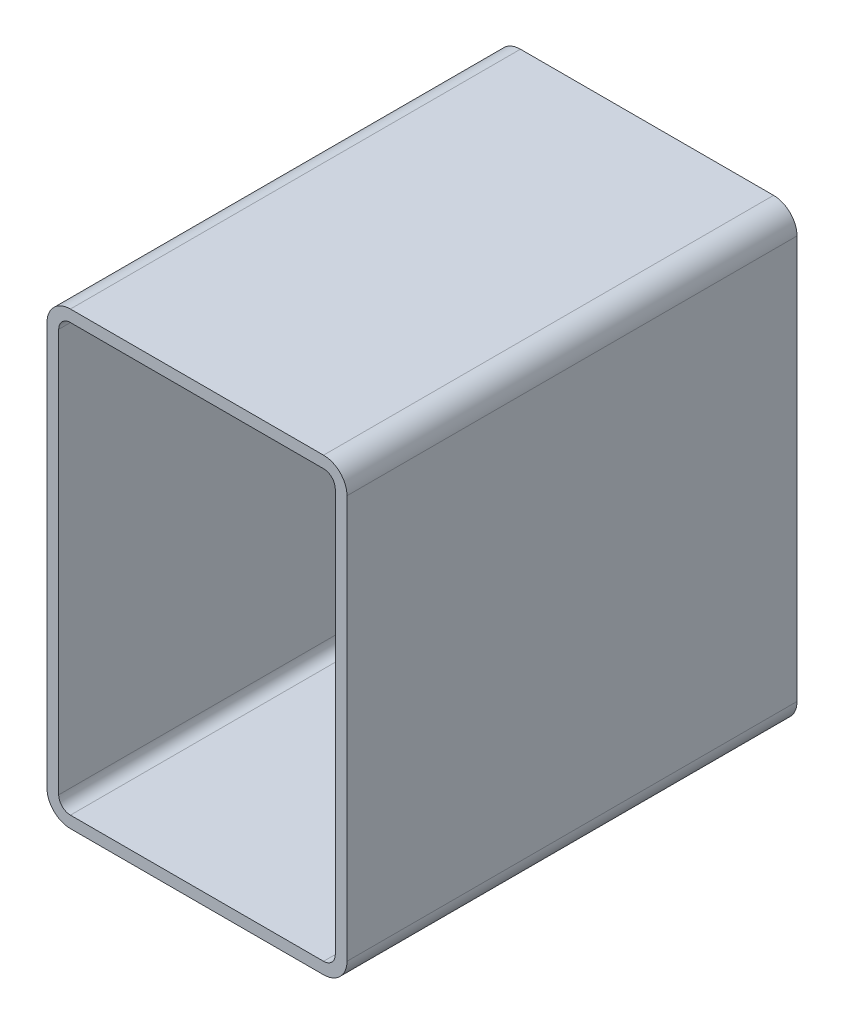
ISO-10303-21;
HEADER;
FILE_DESCRIPTION(('STEP AP214'),'2;1');
FILE_NAME('part.step','',(''),(''),'','','');
FILE_SCHEMA(('AUTOMOTIVE_DESIGN { 1 0 10303 214 1 1 1 1 }'));
ENDSEC;
DATA;
#1=APPLICATION_CONTEXT('core data for automotive mechanical design processes');
#2=APPLICATION_PROTOCOL_DEFINITION('international standard','automotive_design',2000,#1);
#3=PRODUCT_CONTEXT('',#1,'mechanical');
#4=PRODUCT('Part','Part','',(#3));
#5=PRODUCT_RELATED_PRODUCT_CATEGORY('part','',(#4));
#6=PRODUCT_DEFINITION_FORMATION('','',#4);
#7=PRODUCT_DEFINITION_CONTEXT('part definition',#1,'design');
#8=PRODUCT_DEFINITION('design','',#6,#7);
#9=PRODUCT_DEFINITION_SHAPE('','',#8);
#10=(LENGTH_UNIT() NAMED_UNIT(*) SI_UNIT(.MILLI.,.METRE.));
#11=(NAMED_UNIT(*) PLANE_ANGLE_UNIT() SI_UNIT($,.RADIAN.));
#12=(NAMED_UNIT(*) SI_UNIT($,.STERADIAN.) SOLID_ANGLE_UNIT());
#13=UNCERTAINTY_MEASURE_WITH_UNIT(LENGTH_MEASURE(1.E-05),#10,'distance_accuracy_value','');
#14=(GEOMETRIC_REPRESENTATION_CONTEXT(3) GLOBAL_UNCERTAINTY_ASSIGNED_CONTEXT((#13)) GLOBAL_UNIT_ASSIGNED_CONTEXT((#10,
#11,#12)) REPRESENTATION_CONTEXT('',''));
#15=CARTESIAN_POINT('',(0.,0.,0.));
#16=DIRECTION('',(0.,0.,1.));
#17=DIRECTION('',(1.,0.,0.));
#18=AXIS2_PLACEMENT_3D('',#15,#16,#17);
#19=CARTESIAN_POINT('',(17.2659404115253,290.799496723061,304.8));
#20=DIRECTION('',(0.,0.,1.));
#21=DIRECTION('',(1.,0.,0.));
#22=AXIS2_PLACEMENT_3D('',#19,#20,#21);
#23=PLANE('',#22);
#24=CARTESIAN_POINT('',(17.2659404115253,290.799496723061,304.8));
#25=DIRECTION('',(0.,0.,1.));
#26=DIRECTION('',(1.,0.,0.));
#27=AXIS2_PLACEMENT_3D('',#24,#25,#26);
#28=CIRCLE('',#27,15.875);
#29=CARTESIAN_POINT('',(17.2659404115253,306.674496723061,304.8));
#30=VERTEX_POINT('',#29);
#31=CARTESIAN_POINT('',(1.3909404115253,290.799496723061,304.8));
#32=VERTEX_POINT('',#31);
#33=EDGE_CURVE('E211',#30,#32,#28,.T.);
#34=ORIENTED_EDGE('',*,*,#33,.T.);
#35=DIRECTION('',(0.,-1.,0.));
#36=VECTOR('',#35,1.);
#37=CARTESIAN_POINT('',(1.3909404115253,17.7494967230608,304.8));
#38=LINE('',#37,#36);
#39=CARTESIAN_POINT('',(1.3909404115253,17.7494967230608,304.8));
#40=VERTEX_POINT('',#39);
#41=EDGE_CURVE('E214',#32,#40,#38,.T.);
#42=ORIENTED_EDGE('',*,*,#41,.T.);
#43=CARTESIAN_POINT('',(17.2659404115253,17.7494967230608,304.8));
#44=DIRECTION('',(0.,0.,1.));
#45=DIRECTION('',(1.,0.,0.));
#46=AXIS2_PLACEMENT_3D('',#43,#44,#45);
#47=CIRCLE('',#46,15.875);
#48=CARTESIAN_POINT('',(17.2659404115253,1.87449672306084,304.8));
#49=VERTEX_POINT('',#48);
#50=EDGE_CURVE('E217',#40,#49,#47,.T.);
#51=ORIENTED_EDGE('',*,*,#50,.T.);
#52=DIRECTION('',(1.,0.,0.));
#53=VECTOR('',#52,1.);
#54=CARTESIAN_POINT('',(188.715940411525,1.87449672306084,304.8));
#55=LINE('',#54,#53);
#56=CARTESIAN_POINT('',(188.715940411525,1.87449672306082,304.8));
#57=VERTEX_POINT('',#56);
#58=EDGE_CURVE('E219',#49,#57,#55,.T.);
#59=ORIENTED_EDGE('',*,*,#58,.T.);
#60=CARTESIAN_POINT('',(188.715940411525,17.7494967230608,304.8));
#61=DIRECTION('',(0.,0.,1.));
#62=DIRECTION('',(1.,0.,0.));
#63=AXIS2_PLACEMENT_3D('',#60,#61,#62);
#64=CIRCLE('',#63,15.875);
#65=CARTESIAN_POINT('',(204.590940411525,17.7494967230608,304.8));
#66=VERTEX_POINT('',#65);
#67=EDGE_CURVE('E221',#57,#66,#64,.T.);
#68=ORIENTED_EDGE('',*,*,#67,.T.);
#69=DIRECTION('',(0.,1.,0.));
#70=VECTOR('',#69,1.);
#71=CARTESIAN_POINT('',(204.590940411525,290.799496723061,304.8));
#72=LINE('',#71,#70);
#73=CARTESIAN_POINT('',(204.590940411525,290.799496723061,304.8));
#74=VERTEX_POINT('',#73);
#75=EDGE_CURVE('E223',#66,#74,#72,.T.);
#76=ORIENTED_EDGE('',*,*,#75,.T.);
#77=CARTESIAN_POINT('',(188.715940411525,290.799496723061,304.8));
#78=DIRECTION('',(0.,0.,1.));
#79=DIRECTION('',(1.,0.,0.));
#80=AXIS2_PLACEMENT_3D('',#77,#78,#79);
#81=CIRCLE('',#80,15.875);
#82=CARTESIAN_POINT('',(188.715940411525,306.674496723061,304.8));
#83=VERTEX_POINT('',#82);
#84=EDGE_CURVE('E225',#74,#83,#81,.T.);
#85=ORIENTED_EDGE('',*,*,#84,.T.);
#86=DIRECTION('',(-1.,0.,0.));
#87=VECTOR('',#86,1.);
#88=CARTESIAN_POINT('',(17.2659404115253,306.674496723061,304.8));
#89=LINE('',#88,#87);
#90=EDGE_CURVE('E227',#83,#30,#89,.T.);
#91=ORIENTED_EDGE('',*,*,#90,.T.);
#92=EDGE_LOOP('',(#34,#42,#51,#59,#68,#76,#85,#91));
#93=FACE_BOUND('',#92,.T.);
#94=DIRECTION('',(0.,-1.,0.));
#95=VECTOR('',#94,1.);
#96=CARTESIAN_POINT('',(9.3284404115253,17.7494967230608,304.8));
#97=LINE('',#96,#95);
#98=CARTESIAN_POINT('',(9.3284404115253,290.799496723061,304.8));
#99=VERTEX_POINT('',#98);
#100=CARTESIAN_POINT('',(9.3284404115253,17.7494967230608,304.8));
#101=VERTEX_POINT('',#100);
#102=EDGE_CURVE('E154',#99,#101,#97,.T.);
#103=ORIENTED_EDGE('',*,*,#102,.F.);
#104=CARTESIAN_POINT('',(17.2659404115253,290.799496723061,304.8));
#105=DIRECTION('',(0.,0.,1.));
#106=DIRECTION('',(1.,0.,0.));
#107=AXIS2_PLACEMENT_3D('',#104,#105,#106);
#108=CIRCLE('',#107,7.9375);
#109=CARTESIAN_POINT('',(17.2659404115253,298.736996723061,304.8));
#110=VERTEX_POINT('',#109);
#111=EDGE_CURVE('E146',#110,#99,#108,.T.);
#112=ORIENTED_EDGE('',*,*,#111,.F.);
#113=DIRECTION('',(-1.,0.,0.));
#114=VECTOR('',#113,1.);
#115=CARTESIAN_POINT('',(17.2659404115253,298.736996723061,304.8));
#116=LINE('',#115,#114);
#117=CARTESIAN_POINT('',(188.715940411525,298.736996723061,304.8));
#118=VERTEX_POINT('',#117);
#119=EDGE_CURVE('E179',#118,#110,#116,.T.);
#120=ORIENTED_EDGE('',*,*,#119,.F.);
#121=CARTESIAN_POINT('',(188.715940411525,290.799496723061,304.8));
#122=DIRECTION('',(0.,0.,1.));
#123=DIRECTION('',(1.,0.,0.));
#124=AXIS2_PLACEMENT_3D('',#121,#122,#123);
#125=CIRCLE('',#124,7.93750000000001);
#126=CARTESIAN_POINT('',(196.653440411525,290.799496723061,304.8));
#127=VERTEX_POINT('',#126);
#128=EDGE_CURVE('E177',#127,#118,#125,.T.);
#129=ORIENTED_EDGE('',*,*,#128,.F.);
#130=DIRECTION('',(0.,1.,0.));
#131=VECTOR('',#130,1.);
#132=CARTESIAN_POINT('',(196.653440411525,290.799496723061,304.8));
#133=LINE('',#132,#131);
#134=CARTESIAN_POINT('',(196.653440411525,17.7494967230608,304.8));
#135=VERTEX_POINT('',#134);
#136=EDGE_CURVE('E175',#135,#127,#133,.T.);
#137=ORIENTED_EDGE('',*,*,#136,.F.);
#138=CARTESIAN_POINT('',(188.715940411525,17.7494967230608,304.8));
#139=DIRECTION('',(0.,0.,1.));
#140=DIRECTION('',(1.,0.,0.));
#141=AXIS2_PLACEMENT_3D('',#138,#139,#140);
#142=CIRCLE('',#141,7.93750000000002);
#143=CARTESIAN_POINT('',(188.715940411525,9.81199672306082,304.8));
#144=VERTEX_POINT('',#143);
#145=EDGE_CURVE('E173',#144,#135,#142,.T.);
#146=ORIENTED_EDGE('',*,*,#145,.F.);
#147=DIRECTION('',(1.,0.,0.));
#148=VECTOR('',#147,1.);
#149=CARTESIAN_POINT('',(188.715940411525,9.81199672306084,304.8));
#150=LINE('',#149,#148);
#151=CARTESIAN_POINT('',(17.2659404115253,9.81199672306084,304.8));
#152=VERTEX_POINT('',#151);
#153=EDGE_CURVE('E169',#152,#144,#150,.T.);
#154=ORIENTED_EDGE('',*,*,#153,.F.);
#155=CARTESIAN_POINT('',(17.2659404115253,17.7494967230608,304.8));
#156=DIRECTION('',(0.,0.,1.));
#157=DIRECTION('',(1.,0.,0.));
#158=AXIS2_PLACEMENT_3D('',#155,#156,#157);
#159=CIRCLE('',#158,7.9375);
#160=EDGE_CURVE('E167',#101,#152,#159,.T.);
#161=ORIENTED_EDGE('',*,*,#160,.F.);
#162=EDGE_LOOP('',(#103,#112,#120,#129,#137,#146,#154,#161));
#163=FACE_BOUND('',#162,.T.);
#164=ADVANCED_FACE('F33',(#93,#163),#23,.T.);
#165=CARTESIAN_POINT('',(17.2659404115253,290.799496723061,0.));
#166=DIRECTION('',(0.,0.,1.));
#167=DIRECTION('',(1.,0.,0.));
#168=AXIS2_PLACEMENT_3D('',#165,#166,#167);
#169=PLANE('',#168);
#170=CARTESIAN_POINT('',(17.2659404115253,290.799496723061,0.));
#171=DIRECTION('',(0.,0.,1.));
#172=DIRECTION('',(1.,0.,0.));
#173=AXIS2_PLACEMENT_3D('',#170,#171,#172);
#174=CIRCLE('',#173,15.875);
#175=CARTESIAN_POINT('',(17.2659404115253,306.674496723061,0.));
#176=VERTEX_POINT('',#175);
#177=CARTESIAN_POINT('',(1.3909404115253,290.799496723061,0.));
#178=VERTEX_POINT('',#177);
#179=EDGE_CURVE('E162',#176,#178,#174,.T.);
#180=ORIENTED_EDGE('',*,*,#179,.F.);
#181=DIRECTION('',(-1.,0.,0.));
#182=VECTOR('',#181,1.);
#183=CARTESIAN_POINT('',(17.2659404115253,306.674496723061,0.));
#184=LINE('',#183,#182);
#185=CARTESIAN_POINT('',(188.715940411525,306.674496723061,0.));
#186=VERTEX_POINT('',#185);
#187=EDGE_CURVE('E215',#186,#176,#184,.T.);
#188=ORIENTED_EDGE('',*,*,#187,.F.);
#189=CARTESIAN_POINT('',(188.715940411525,290.799496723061,0.));
#190=DIRECTION('',(0.,0.,1.));
#191=DIRECTION('',(1.,0.,0.));
#192=AXIS2_PLACEMENT_3D('',#189,#190,#191);
#193=CIRCLE('',#192,15.875);
#194=CARTESIAN_POINT('',(204.590940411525,290.799496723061,0.));
#195=VERTEX_POINT('',#194);
#196=EDGE_CURVE('E242',#195,#186,#193,.T.);
#197=ORIENTED_EDGE('',*,*,#196,.F.);
#198=DIRECTION('',(0.,1.,0.));
#199=VECTOR('',#198,1.);
#200=CARTESIAN_POINT('',(204.590940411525,290.799496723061,0.));
#201=LINE('',#200,#199);
#202=CARTESIAN_POINT('',(204.590940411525,17.7494967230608,0.));
#203=VERTEX_POINT('',#202);
#204=EDGE_CURVE('E240',#203,#195,#201,.T.);
#205=ORIENTED_EDGE('',*,*,#204,.F.);
#206=CARTESIAN_POINT('',(188.715940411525,17.7494967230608,0.));
#207=DIRECTION('',(0.,0.,1.));
#208=DIRECTION('',(1.,0.,0.));
#209=AXIS2_PLACEMENT_3D('',#206,#207,#208);
#210=CIRCLE('',#209,15.875);
#211=CARTESIAN_POINT('',(188.715940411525,1.87449672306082,0.));
#212=VERTEX_POINT('',#211);
#213=EDGE_CURVE('E238',#212,#203,#210,.T.);
#214=ORIENTED_EDGE('',*,*,#213,.F.);
#215=DIRECTION('',(1.,0.,0.));
#216=VECTOR('',#215,1.);
#217=CARTESIAN_POINT('',(188.715940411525,1.87449672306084,0.));
#218=LINE('',#217,#216);
#219=CARTESIAN_POINT('',(17.2659404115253,1.87449672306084,0.));
#220=VERTEX_POINT('',#219);
#221=EDGE_CURVE('E236',#220,#212,#218,.T.);
#222=ORIENTED_EDGE('',*,*,#221,.F.);
#223=CARTESIAN_POINT('',(17.2659404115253,17.7494967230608,0.));
#224=DIRECTION('',(0.,0.,1.));
#225=DIRECTION('',(1.,0.,0.));
#226=AXIS2_PLACEMENT_3D('',#223,#224,#225);
#227=CIRCLE('',#226,15.875);
#228=CARTESIAN_POINT('',(1.3909404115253,17.7494967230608,0.));
#229=VERTEX_POINT('',#228);
#230=EDGE_CURVE('E234',#229,#220,#227,.T.);
#231=ORIENTED_EDGE('',*,*,#230,.F.);
#232=DIRECTION('',(0.,-1.,0.));
#233=VECTOR('',#232,1.);
#234=CARTESIAN_POINT('',(1.3909404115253,17.7494967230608,0.));
#235=LINE('',#234,#233);
#236=EDGE_CURVE('E232',#178,#229,#235,.T.);
#237=ORIENTED_EDGE('',*,*,#236,.F.);
#238=EDGE_LOOP('',(#180,#188,#197,#205,#214,#222,#231,#237));
#239=FACE_BOUND('',#238,.T.);
#240=CARTESIAN_POINT('',(17.2659404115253,290.799496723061,0.));
#241=DIRECTION('',(0.,0.,1.));
#242=DIRECTION('',(1.,0.,0.));
#243=AXIS2_PLACEMENT_3D('',#240,#241,#242);
#244=CIRCLE('',#243,7.9375);
#245=CARTESIAN_POINT('',(17.2659404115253,298.736996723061,0.));
#246=VERTEX_POINT('',#245);
#247=CARTESIAN_POINT('',(9.3284404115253,290.799496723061,0.));
#248=VERTEX_POINT('',#247);
#249=EDGE_CURVE('E56',#246,#248,#244,.T.);
#250=ORIENTED_EDGE('',*,*,#249,.T.);
#251=DIRECTION('',(0.,-1.,0.));
#252=VECTOR('',#251,1.);
#253=CARTESIAN_POINT('',(9.3284404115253,17.7494967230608,0.));
#254=LINE('',#253,#252);
#255=CARTESIAN_POINT('',(9.3284404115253,17.7494967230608,0.));
#256=VERTEX_POINT('',#255);
#257=EDGE_CURVE('E161',#248,#256,#254,.T.);
#258=ORIENTED_EDGE('',*,*,#257,.T.);
#259=CARTESIAN_POINT('',(17.2659404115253,17.7494967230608,0.));
#260=DIRECTION('',(0.,0.,1.));
#261=DIRECTION('',(1.,0.,0.));
#262=AXIS2_PLACEMENT_3D('',#259,#260,#261);
#263=CIRCLE('',#262,7.9375);
#264=CARTESIAN_POINT('',(17.2659404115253,9.81199672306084,0.));
#265=VERTEX_POINT('',#264);
#266=EDGE_CURVE('E183',#256,#265,#263,.T.);
#267=ORIENTED_EDGE('',*,*,#266,.T.);
#268=DIRECTION('',(1.,0.,0.));
#269=VECTOR('',#268,1.);
#270=CARTESIAN_POINT('',(188.715940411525,9.81199672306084,0.));
#271=LINE('',#270,#269);
#272=CARTESIAN_POINT('',(188.715940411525,9.81199672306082,0.));
#273=VERTEX_POINT('',#272);
#274=EDGE_CURVE('E186',#265,#273,#271,.T.);
#275=ORIENTED_EDGE('',*,*,#274,.T.);
#276=CARTESIAN_POINT('',(188.715940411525,17.7494967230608,0.));
#277=DIRECTION('',(0.,0.,1.));
#278=DIRECTION('',(1.,0.,0.));
#279=AXIS2_PLACEMENT_3D('',#276,#277,#278);
#280=CIRCLE('',#279,7.93750000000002);
#281=CARTESIAN_POINT('',(196.653440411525,17.7494967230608,0.));
#282=VERTEX_POINT('',#281);
#283=EDGE_CURVE('E189',#273,#282,#280,.T.);
#284=ORIENTED_EDGE('',*,*,#283,.T.);
#285=DIRECTION('',(0.,1.,0.));
#286=VECTOR('',#285,1.);
#287=CARTESIAN_POINT('',(196.653440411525,290.799496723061,0.));
#288=LINE('',#287,#286);
#289=CARTESIAN_POINT('',(196.653440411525,290.799496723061,0.));
#290=VERTEX_POINT('',#289);
#291=EDGE_CURVE('E192',#282,#290,#288,.T.);
#292=ORIENTED_EDGE('',*,*,#291,.T.);
#293=CARTESIAN_POINT('',(188.715940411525,290.799496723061,0.));
#294=DIRECTION('',(0.,0.,1.));
#295=DIRECTION('',(1.,0.,0.));
#296=AXIS2_PLACEMENT_3D('',#293,#294,#295);
#297=CIRCLE('',#296,7.93750000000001);
#298=CARTESIAN_POINT('',(188.715940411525,298.736996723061,0.));
#299=VERTEX_POINT('',#298);
#300=EDGE_CURVE('E195',#290,#299,#297,.T.);
#301=ORIENTED_EDGE('',*,*,#300,.T.);
#302=DIRECTION('',(-1.,0.,0.));
#303=VECTOR('',#302,1.);
#304=CARTESIAN_POINT('',(17.2659404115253,298.736996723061,0.));
#305=LINE('',#304,#303);
#306=EDGE_CURVE('E155',#299,#246,#305,.T.);
#307=ORIENTED_EDGE('',*,*,#306,.T.);
#308=EDGE_LOOP('',(#250,#258,#267,#275,#284,#292,#301,#307));
#309=FACE_BOUND('',#308,.T.);
#310=ADVANCED_FACE('F272',(#239,#309),#169,.F.);
#311=CARTESIAN_POINT('',(17.2659404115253,290.799496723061,304.8));
#312=DIRECTION('',(0.,0.,-1.));
#313=DIRECTION('',(-1.,0.,0.));
#314=AXIS2_PLACEMENT_3D('',#311,#312,#313);
#315=CYLINDRICAL_SURFACE('',#314,15.875);
#316=ORIENTED_EDGE('',*,*,#179,.T.);
#317=DIRECTION('',(0.,0.,-1.));
#318=VECTOR('',#317,1.);
#319=CARTESIAN_POINT('',(1.3909404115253,290.799496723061,304.8));
#320=LINE('',#319,#318);
#321=EDGE_CURVE('E11',#32,#178,#320,.T.);
#322=ORIENTED_EDGE('',*,*,#321,.F.);
#323=ORIENTED_EDGE('',*,*,#33,.F.);
#324=DIRECTION('',(0.,0.,-1.));
#325=VECTOR('',#324,1.);
#326=CARTESIAN_POINT('',(17.2659404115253,306.674496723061,304.8));
#327=LINE('',#326,#325);
#328=EDGE_CURVE('E229',#30,#176,#327,.T.);
#329=ORIENTED_EDGE('',*,*,#328,.T.);
#330=EDGE_LOOP('',(#316,#322,#323,#329));
#331=FACE_BOUND('',#330,.T.);
#332=ADVANCED_FACE('F35',(#331),#315,.T.);
#333=CARTESIAN_POINT('',(1.3909404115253,17.7494967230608,304.8));
#334=DIRECTION('',(1.,0.,0.));
#335=DIRECTION('',(0.,0.,-1.));
#336=AXIS2_PLACEMENT_3D('',#333,#334,#335);
#337=PLANE('',#336);
#338=ORIENTED_EDGE('',*,*,#236,.T.);
#339=DIRECTION('',(0.,0.,-1.));
#340=VECTOR('',#339,1.);
#341=CARTESIAN_POINT('',(1.3909404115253,17.7494967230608,304.8));
#342=LINE('',#341,#340);
#343=EDGE_CURVE('E41',#40,#229,#342,.T.);
#344=ORIENTED_EDGE('',*,*,#343,.F.);
#345=ORIENTED_EDGE('',*,*,#41,.F.);
#346=ORIENTED_EDGE('',*,*,#321,.T.);
#347=EDGE_LOOP('',(#338,#344,#345,#346));
#348=FACE_BOUND('',#347,.T.);
#349=ADVANCED_FACE('F289',(#348),#337,.F.);
#350=CARTESIAN_POINT('',(17.2659404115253,17.7494967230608,304.8));
#351=DIRECTION('',(0.,0.,-1.));
#352=DIRECTION('',(-1.,0.,0.));
#353=AXIS2_PLACEMENT_3D('',#350,#351,#352);
#354=CYLINDRICAL_SURFACE('',#353,15.875);
#355=ORIENTED_EDGE('',*,*,#230,.T.);
#356=DIRECTION('',(0.,0.,-1.));
#357=VECTOR('',#356,1.);
#358=CARTESIAN_POINT('',(17.2659404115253,1.87449672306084,304.8));
#359=LINE('',#358,#357);
#360=EDGE_CURVE('E259',#49,#220,#359,.T.);
#361=ORIENTED_EDGE('',*,*,#360,.F.);
#362=ORIENTED_EDGE('',*,*,#50,.F.);
#363=ORIENTED_EDGE('',*,*,#343,.T.);
#364=EDGE_LOOP('',(#355,#361,#362,#363));
#365=FACE_BOUND('',#364,.T.);
#366=ADVANCED_FACE('F266',(#365),#354,.T.);
#367=CARTESIAN_POINT('',(188.715940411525,1.87449672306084,304.8));
#368=DIRECTION('',(0.,1.,0.));
#369=DIRECTION('',(0.,0.,1.));
#370=AXIS2_PLACEMENT_3D('',#367,#368,#369);
#371=PLANE('',#370);
#372=ORIENTED_EDGE('',*,*,#221,.T.);
#373=DIRECTION('',(0.,0.,-1.));
#374=VECTOR('',#373,1.);
#375=CARTESIAN_POINT('',(188.715940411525,1.87449672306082,304.8));
#376=LINE('',#375,#374);
#377=EDGE_CURVE('E256',#57,#212,#376,.T.);
#378=ORIENTED_EDGE('',*,*,#377,.F.);
#379=ORIENTED_EDGE('',*,*,#58,.F.);
#380=ORIENTED_EDGE('',*,*,#360,.T.);
#381=EDGE_LOOP('',(#372,#378,#379,#380));
#382=FACE_BOUND('',#381,.T.);
#383=ADVANCED_FACE('F278',(#382),#371,.F.);
#384=CARTESIAN_POINT('',(188.715940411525,17.7494967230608,304.8));
#385=DIRECTION('',(0.,0.,-1.));
#386=DIRECTION('',(-1.,0.,0.));
#387=AXIS2_PLACEMENT_3D('',#384,#385,#386);
#388=CYLINDRICAL_SURFACE('',#387,15.875);
#389=ORIENTED_EDGE('',*,*,#213,.T.);
#390=DIRECTION('',(0.,0.,-1.));
#391=VECTOR('',#390,1.);
#392=CARTESIAN_POINT('',(204.590940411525,17.7494967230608,304.8));
#393=LINE('',#392,#391);
#394=EDGE_CURVE('E253',#66,#203,#393,.T.);
#395=ORIENTED_EDGE('',*,*,#394,.F.);
#396=ORIENTED_EDGE('',*,*,#67,.F.);
#397=ORIENTED_EDGE('',*,*,#377,.T.);
#398=EDGE_LOOP('',(#389,#395,#396,#397));
#399=FACE_BOUND('',#398,.T.);
#400=ADVANCED_FACE('F282',(#399),#388,.T.);
#401=CARTESIAN_POINT('',(204.590940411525,290.799496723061,304.8));
#402=DIRECTION('',(-1.,0.,0.));
#403=DIRECTION('',(0.,0.,1.));
#404=AXIS2_PLACEMENT_3D('',#401,#402,#403);
#405=PLANE('',#404);
#406=ORIENTED_EDGE('',*,*,#204,.T.);
#407=DIRECTION('',(0.,0.,-1.));
#408=VECTOR('',#407,1.);
#409=CARTESIAN_POINT('',(204.590940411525,290.799496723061,304.8));
#410=LINE('',#409,#408);
#411=EDGE_CURVE('E250',#74,#195,#410,.T.);
#412=ORIENTED_EDGE('',*,*,#411,.F.);
#413=ORIENTED_EDGE('',*,*,#75,.F.);
#414=ORIENTED_EDGE('',*,*,#394,.T.);
#415=EDGE_LOOP('',(#406,#412,#413,#414));
#416=FACE_BOUND('',#415,.T.);
#417=ADVANCED_FACE('F302',(#416),#405,.F.);
#418=CARTESIAN_POINT('',(188.715940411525,290.799496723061,304.8));
#419=DIRECTION('',(0.,0.,-1.));
#420=DIRECTION('',(-1.,0.,0.));
#421=AXIS2_PLACEMENT_3D('',#418,#419,#420);
#422=CYLINDRICAL_SURFACE('',#421,15.875);
#423=ORIENTED_EDGE('',*,*,#196,.T.);
#424=DIRECTION('',(0.,0.,-1.));
#425=VECTOR('',#424,1.);
#426=CARTESIAN_POINT('',(188.715940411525,306.674496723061,304.8));
#427=LINE('',#426,#425);
#428=EDGE_CURVE('E247',#83,#186,#427,.T.);
#429=ORIENTED_EDGE('',*,*,#428,.F.);
#430=ORIENTED_EDGE('',*,*,#84,.F.);
#431=ORIENTED_EDGE('',*,*,#411,.T.);
#432=EDGE_LOOP('',(#423,#429,#430,#431));
#433=FACE_BOUND('',#432,.T.);
#434=ADVANCED_FACE('F300',(#433),#422,.T.);
#435=CARTESIAN_POINT('',(17.2659404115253,306.674496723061,304.8));
#436=DIRECTION('',(0.,-1.,0.));
#437=DIRECTION('',(0.,0.,-1.));
#438=AXIS2_PLACEMENT_3D('',#435,#436,#437);
#439=PLANE('',#438);
#440=ORIENTED_EDGE('',*,*,#187,.T.);
#441=ORIENTED_EDGE('',*,*,#328,.F.);
#442=ORIENTED_EDGE('',*,*,#90,.F.);
#443=ORIENTED_EDGE('',*,*,#428,.T.);
#444=EDGE_LOOP('',(#440,#441,#442,#443));
#445=FACE_BOUND('',#444,.T.);
#446=ADVANCED_FACE('F295',(#445),#439,.F.);
#447=CARTESIAN_POINT('',(17.2659404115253,290.799496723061,304.8));
#448=DIRECTION('',(0.,0.,-1.));
#449=DIRECTION('',(-1.,0.,0.));
#450=AXIS2_PLACEMENT_3D('',#447,#448,#449);
#451=CYLINDRICAL_SURFACE('',#450,7.9375);
#452=ORIENTED_EDGE('',*,*,#249,.F.);
#453=DIRECTION('',(0.,0.,-1.));
#454=VECTOR('',#453,1.);
#455=CARTESIAN_POINT('',(17.2659404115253,298.736996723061,304.8));
#456=LINE('',#455,#454);
#457=EDGE_CURVE('E150',#110,#246,#456,.T.);
#458=ORIENTED_EDGE('',*,*,#457,.F.);
#459=ORIENTED_EDGE('',*,*,#111,.T.);
#460=DIRECTION('',(0.,0.,-1.));
#461=VECTOR('',#460,1.);
#462=CARTESIAN_POINT('',(9.3284404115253,290.799496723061,304.8));
#463=LINE('',#462,#461);
#464=EDGE_CURVE('E149',#99,#248,#463,.T.);
#465=ORIENTED_EDGE('',*,*,#464,.T.);
#466=EDGE_LOOP('',(#452,#458,#459,#465));
#467=FACE_BOUND('',#466,.T.);
#468=ADVANCED_FACE('F148',(#467),#451,.F.);
#469=CARTESIAN_POINT('',(9.3284404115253,17.7494967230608,304.8));
#470=DIRECTION('',(1.,0.,0.));
#471=DIRECTION('',(0.,0.,-1.));
#472=AXIS2_PLACEMENT_3D('',#469,#470,#471);
#473=PLANE('',#472);
#474=ORIENTED_EDGE('',*,*,#257,.F.);
#475=ORIENTED_EDGE('',*,*,#464,.F.);
#476=ORIENTED_EDGE('',*,*,#102,.T.);
#477=DIRECTION('',(0.,0.,-1.));
#478=VECTOR('',#477,1.);
#479=CARTESIAN_POINT('',(9.3284404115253,17.7494967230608,304.8));
#480=LINE('',#479,#478);
#481=EDGE_CURVE('E163',#101,#256,#480,.T.);
#482=ORIENTED_EDGE('',*,*,#481,.T.);
#483=EDGE_LOOP('',(#474,#475,#476,#482));
#484=FACE_BOUND('',#483,.T.);
#485=ADVANCED_FACE('F158',(#484),#473,.T.);
#486=CARTESIAN_POINT('',(17.2659404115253,17.7494967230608,304.8));
#487=DIRECTION('',(0.,0.,-1.));
#488=DIRECTION('',(-1.,0.,0.));
#489=AXIS2_PLACEMENT_3D('',#486,#487,#488);
#490=CYLINDRICAL_SURFACE('',#489,7.9375);
#491=ORIENTED_EDGE('',*,*,#266,.F.);
#492=ORIENTED_EDGE('',*,*,#481,.F.);
#493=ORIENTED_EDGE('',*,*,#160,.T.);
#494=DIRECTION('',(0.,0.,-1.));
#495=VECTOR('',#494,1.);
#496=CARTESIAN_POINT('',(17.2659404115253,9.81199672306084,304.8));
#497=LINE('',#496,#495);
#498=EDGE_CURVE('E208',#152,#265,#497,.T.);
#499=ORIENTED_EDGE('',*,*,#498,.T.);
#500=EDGE_LOOP('',(#491,#492,#493,#499));
#501=FACE_BOUND('',#500,.T.);
#502=ADVANCED_FACE('F327',(#501),#490,.F.);
#503=CARTESIAN_POINT('',(188.715940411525,9.81199672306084,304.8));
#504=DIRECTION('',(0.,1.,0.));
#505=DIRECTION('',(0.,0.,1.));
#506=AXIS2_PLACEMENT_3D('',#503,#504,#505);
#507=PLANE('',#506);
#508=ORIENTED_EDGE('',*,*,#274,.F.);
#509=ORIENTED_EDGE('',*,*,#498,.F.);
#510=ORIENTED_EDGE('',*,*,#153,.T.);
#511=DIRECTION('',(0.,0.,-1.));
#512=VECTOR('',#511,1.);
#513=CARTESIAN_POINT('',(188.715940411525,9.81199672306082,304.8));
#514=LINE('',#513,#512);
#515=EDGE_CURVE('E206',#144,#273,#514,.T.);
#516=ORIENTED_EDGE('',*,*,#515,.T.);
#517=EDGE_LOOP('',(#508,#509,#510,#516));
#518=FACE_BOUND('',#517,.T.);
#519=ADVANCED_FACE('F331',(#518),#507,.T.);
#520=CARTESIAN_POINT('',(188.715940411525,17.7494967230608,304.8));
#521=DIRECTION('',(0.,0.,-1.));
#522=DIRECTION('',(-1.,0.,0.));
#523=AXIS2_PLACEMENT_3D('',#520,#521,#522);
#524=CYLINDRICAL_SURFACE('',#523,7.93750000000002);
#525=ORIENTED_EDGE('',*,*,#283,.F.);
#526=ORIENTED_EDGE('',*,*,#515,.F.);
#527=ORIENTED_EDGE('',*,*,#145,.T.);
#528=DIRECTION('',(0.,0.,-1.));
#529=VECTOR('',#528,1.);
#530=CARTESIAN_POINT('',(196.653440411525,17.7494967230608,304.8));
#531=LINE('',#530,#529);
#532=EDGE_CURVE('E204',#135,#282,#531,.T.);
#533=ORIENTED_EDGE('',*,*,#532,.T.);
#534=EDGE_LOOP('',(#525,#526,#527,#533));
#535=FACE_BOUND('',#534,.T.);
#536=ADVANCED_FACE('F337',(#535),#524,.F.);
#537=CARTESIAN_POINT('',(196.653440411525,290.799496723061,304.8));
#538=DIRECTION('',(-1.,0.,0.));
#539=DIRECTION('',(0.,0.,1.));
#540=AXIS2_PLACEMENT_3D('',#537,#538,#539);
#541=PLANE('',#540);
#542=ORIENTED_EDGE('',*,*,#291,.F.);
#543=ORIENTED_EDGE('',*,*,#532,.F.);
#544=ORIENTED_EDGE('',*,*,#136,.T.);
#545=DIRECTION('',(0.,0.,-1.));
#546=VECTOR('',#545,1.);
#547=CARTESIAN_POINT('',(196.653440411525,290.799496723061,304.8));
#548=LINE('',#547,#546);
#549=EDGE_CURVE('E202',#127,#290,#548,.T.);
#550=ORIENTED_EDGE('',*,*,#549,.T.);
#551=EDGE_LOOP('',(#542,#543,#544,#550));
#552=FACE_BOUND('',#551,.T.);
#553=ADVANCED_FACE('F341',(#552),#541,.T.);
#554=CARTESIAN_POINT('',(188.715940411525,290.799496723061,304.8));
#555=DIRECTION('',(0.,0.,-1.));
#556=DIRECTION('',(-1.,0.,0.));
#557=AXIS2_PLACEMENT_3D('',#554,#555,#556);
#558=CYLINDRICAL_SURFACE('',#557,7.93750000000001);
#559=ORIENTED_EDGE('',*,*,#300,.F.);
#560=ORIENTED_EDGE('',*,*,#549,.F.);
#561=ORIENTED_EDGE('',*,*,#128,.T.);
#562=DIRECTION('',(0.,0.,-1.));
#563=VECTOR('',#562,1.);
#564=CARTESIAN_POINT('',(188.715940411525,298.736996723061,304.8));
#565=LINE('',#564,#563);
#566=EDGE_CURVE('E48',#118,#299,#565,.T.);
#567=ORIENTED_EDGE('',*,*,#566,.T.);
#568=EDGE_LOOP('',(#559,#560,#561,#567));
#569=FACE_BOUND('',#568,.T.);
#570=ADVANCED_FACE('F345',(#569),#558,.F.);
#571=CARTESIAN_POINT('',(17.2659404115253,298.736996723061,304.8));
#572=DIRECTION('',(0.,-1.,0.));
#573=DIRECTION('',(0.,0.,-1.));
#574=AXIS2_PLACEMENT_3D('',#571,#572,#573);
#575=PLANE('',#574);
#576=ORIENTED_EDGE('',*,*,#306,.F.);
#577=ORIENTED_EDGE('',*,*,#566,.F.);
#578=ORIENTED_EDGE('',*,*,#119,.T.);
#579=ORIENTED_EDGE('',*,*,#457,.T.);
#580=EDGE_LOOP('',(#576,#577,#578,#579));
#581=FACE_BOUND('',#580,.T.);
#582=ADVANCED_FACE('F349',(#581),#575,.T.);
#583=CLOSED_SHELL('',(#164,#310,#332,#349,#366,#383,#400,#417,#434,#446,#468,#485,#502,#519,
#536,#553,#570,#582));
#584=MANIFOLD_SOLID_BREP('B2',#583);
#585=ADVANCED_BREP_SHAPE_REPRESENTATION('',(#18,#584),#14);
#586=SHAPE_DEFINITION_REPRESENTATION(#9,#585);
ENDSEC;
END-ISO-10303-21;
